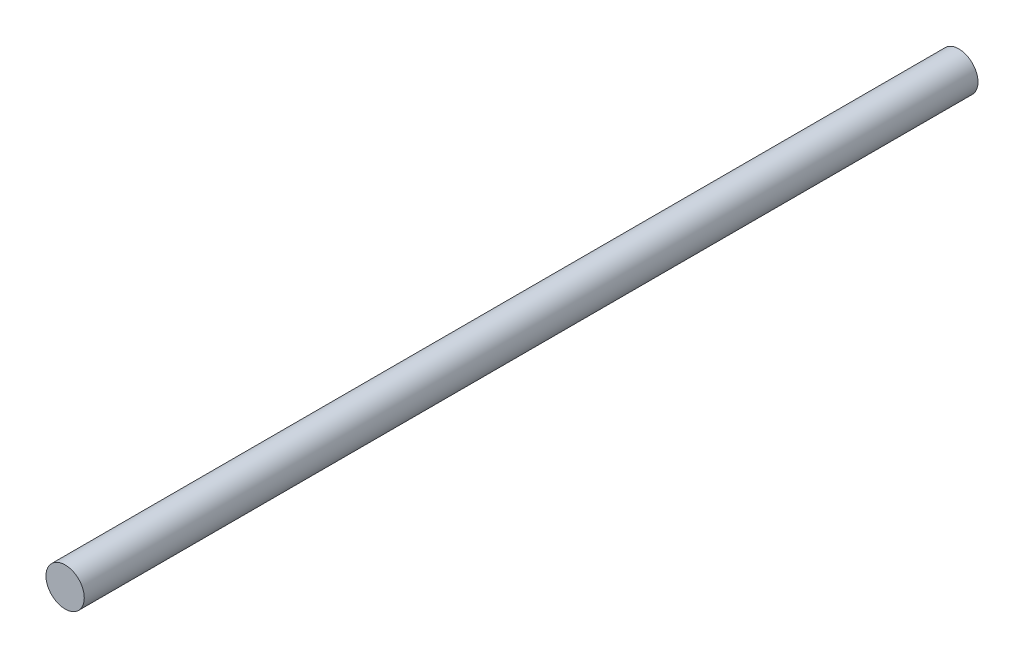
from build123d import *

# Parameters (mm, degrees)
SKETCH1_R           = 1.5
BOSS_EXTRUDE1_DEPTH = 70


with BuildPart() as part:
    # Sketch1 → Boss-Extrude1 (new body)
    with BuildSketch(Plane.XY):
        Circle(SKETCH1_R)
    extrude(amount=BOSS_EXTRUDE1_DEPTH)


solid = part.part
